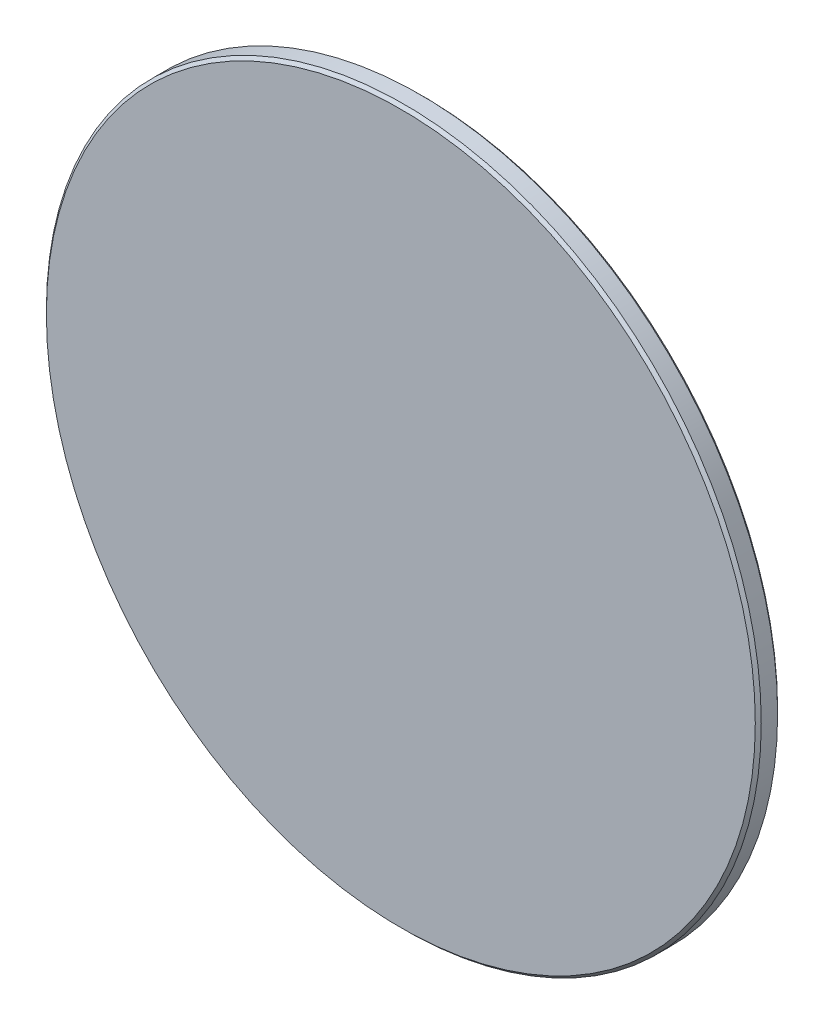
ISO-10303-21;
HEADER;
FILE_DESCRIPTION(('STEP AP214'),'2;1');
FILE_NAME('part.step','',(''),(''),'','','');
FILE_SCHEMA(('AUTOMOTIVE_DESIGN { 1 0 10303 214 1 1 1 1 }'));
ENDSEC;
DATA;
#1=APPLICATION_CONTEXT('core data for automotive mechanical design processes');
#2=APPLICATION_PROTOCOL_DEFINITION('international standard','automotive_design',2000,#1);
#3=PRODUCT_CONTEXT('',#1,'mechanical');
#4=PRODUCT('Part','Part','',(#3));
#5=PRODUCT_RELATED_PRODUCT_CATEGORY('part','',(#4));
#6=PRODUCT_DEFINITION_FORMATION('','',#4);
#7=PRODUCT_DEFINITION_CONTEXT('part definition',#1,'design');
#8=PRODUCT_DEFINITION('design','',#6,#7);
#9=PRODUCT_DEFINITION_SHAPE('','',#8);
#10=(LENGTH_UNIT() NAMED_UNIT(*) SI_UNIT(.MILLI.,.METRE.));
#11=(NAMED_UNIT(*) PLANE_ANGLE_UNIT() SI_UNIT($,.RADIAN.));
#12=(NAMED_UNIT(*) SI_UNIT($,.STERADIAN.) SOLID_ANGLE_UNIT());
#13=UNCERTAINTY_MEASURE_WITH_UNIT(LENGTH_MEASURE(1.E-05),#10,'distance_accuracy_value','');
#14=(GEOMETRIC_REPRESENTATION_CONTEXT(3) GLOBAL_UNCERTAINTY_ASSIGNED_CONTEXT((#13)) GLOBAL_UNIT_ASSIGNED_CONTEXT((#10,
#11,#12)) REPRESENTATION_CONTEXT('',''));
#15=CARTESIAN_POINT('',(0.,0.,0.));
#16=DIRECTION('',(0.,0.,1.));
#17=DIRECTION('',(1.,0.,0.));
#18=AXIS2_PLACEMENT_3D('',#15,#16,#17);
#19=CARTESIAN_POINT('',(0.,0.,2.38125));
#20=DIRECTION('',(0.,0.,-1.));
#21=DIRECTION('',(-1.,0.,0.));
#22=AXIS2_PLACEMENT_3D('',#19,#20,#21);
#23=CYLINDRICAL_SURFACE('',#22,76.2);
#24=CARTESIAN_POINT('',(0.,0.,-1.74624999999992));
#25=DIRECTION('',(0.,0.,1.));
#26=DIRECTION('',(1.,0.,0.));
#27=AXIS2_PLACEMENT_3D('',#24,#25,#26);
#28=CIRCLE('',#27,76.2);
#29=CARTESIAN_POINT('',(-76.2,0.,-1.74624999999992));
#30=VERTEX_POINT('',#29);
#31=EDGE_CURVE('E46',#30,#30,#28,.T.);
#32=CARTESIAN_POINT('',(0.,0.,1.74625000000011));
#33=DIRECTION('',(0.,0.,1.));
#34=DIRECTION('',(1.,0.,0.));
#35=AXIS2_PLACEMENT_3D('',#32,#33,#34);
#36=CIRCLE('',#35,76.2);
#37=CARTESIAN_POINT('',(-76.2,0.,1.74625000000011));
#38=VERTEX_POINT('',#37);
#39=EDGE_CURVE('E50',#38,#38,#36,.F.);
#40=CARTESIAN_POINT('',(-76.2,0.,-1.74624999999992));
#41=CARTESIAN_POINT('',(-76.2,0.,-1.70986979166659));
#42=CARTESIAN_POINT('',(-76.2,0.,-1.67348958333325));
#43=CARTESIAN_POINT('',(-76.2,0.,-1.60072916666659));
#44=CARTESIAN_POINT('',(-76.2,0.,-1.56434895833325));
#45=CARTESIAN_POINT('',(-76.2,0.,-1.49158854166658));
#46=CARTESIAN_POINT('',(-76.2,0.,-1.45520833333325));
#47=CARTESIAN_POINT('',(-76.2,0.,-1.38244791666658));
#48=CARTESIAN_POINT('',(-76.2,0.,-1.34606770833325));
#49=CARTESIAN_POINT('',(-76.2,0.,-1.27330729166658));
#50=CARTESIAN_POINT('',(-76.2,0.,-1.23692708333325));
#51=CARTESIAN_POINT('',(-76.2,0.,-1.16416666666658));
#52=CARTESIAN_POINT('',(-76.2,0.,-1.12778645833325));
#53=CARTESIAN_POINT('',(-76.2,0.,-1.05502604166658));
#54=CARTESIAN_POINT('',(-76.2,0.,-1.01864583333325));
#55=CARTESIAN_POINT('',(-76.2,0.,-0.945885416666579));
#56=CARTESIAN_POINT('',(-76.2,0.,-0.909505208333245));
#57=CARTESIAN_POINT('',(-76.2,0.,-0.836744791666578));
#58=CARTESIAN_POINT('',(-76.2,0.,-0.800364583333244));
#59=CARTESIAN_POINT('',(-76.2,0.,-0.727604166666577));
#60=CARTESIAN_POINT('',(-76.2,0.,-0.691223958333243));
#61=CARTESIAN_POINT('',(-76.2,0.,-0.618463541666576));
#62=CARTESIAN_POINT('',(-76.2,0.,-0.582083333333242));
#63=CARTESIAN_POINT('',(-76.2,0.,-0.509322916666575));
#64=CARTESIAN_POINT('',(-76.2,0.,-0.472942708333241));
#65=CARTESIAN_POINT('',(-76.2,0.,-0.400182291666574));
#66=CARTESIAN_POINT('',(-76.2,0.,-0.36380208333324));
#67=CARTESIAN_POINT('',(-76.2,0.,-0.291041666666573));
#68=CARTESIAN_POINT('',(-76.2,0.,-0.254661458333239));
#69=CARTESIAN_POINT('',(-76.2,0.,-0.181901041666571));
#70=CARTESIAN_POINT('',(-76.2,0.,-0.145520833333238));
#71=CARTESIAN_POINT('',(-76.2,0.,-0.0727604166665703));
#72=CARTESIAN_POINT('',(-76.2,0.,-0.0363802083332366));
#73=CARTESIAN_POINT('',(-76.2,0.,0.0363802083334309));
#74=CARTESIAN_POINT('',(-76.2,0.,0.0727604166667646));
#75=CARTESIAN_POINT('',(-76.2,0.,0.145520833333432));
#76=CARTESIAN_POINT('',(-76.2,0.,0.181901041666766));
#77=CARTESIAN_POINT('',(-76.2,0.,0.254661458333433));
#78=CARTESIAN_POINT('',(-76.2,0.,0.291041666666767));
#79=CARTESIAN_POINT('',(-76.2,0.,0.363802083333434));
#80=CARTESIAN_POINT('',(-76.2,0.,0.400182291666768));
#81=CARTESIAN_POINT('',(-76.2,0.,0.472942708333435));
#82=CARTESIAN_POINT('',(-76.2,0.,0.509322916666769));
#83=CARTESIAN_POINT('',(-76.2,0.,0.582083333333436));
#84=CARTESIAN_POINT('',(-76.2,0.,0.61846354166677));
#85=CARTESIAN_POINT('',(-76.2,0.,0.691223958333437));
#86=CARTESIAN_POINT('',(-76.2,0.,0.727604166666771));
#87=CARTESIAN_POINT('',(-76.2,0.,0.800364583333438));
#88=CARTESIAN_POINT('',(-76.2,0.,0.836744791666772));
#89=CARTESIAN_POINT('',(-76.2,0.,0.90950520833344));
#90=CARTESIAN_POINT('',(-76.2,0.,0.945885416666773));
#91=CARTESIAN_POINT('',(-76.2,0.,1.01864583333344));
#92=CARTESIAN_POINT('',(-76.2,0.,1.05502604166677));
#93=CARTESIAN_POINT('',(-76.2,0.,1.12778645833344));
#94=CARTESIAN_POINT('',(-76.2,0.,1.16416666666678));
#95=CARTESIAN_POINT('',(-76.2,0.,1.23692708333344));
#96=CARTESIAN_POINT('',(-76.2,0.,1.27330729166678));
#97=CARTESIAN_POINT('',(-76.2,0.,1.34606770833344));
#98=CARTESIAN_POINT('',(-76.2,0.,1.38244791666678));
#99=CARTESIAN_POINT('',(-76.2,0.,1.45520833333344));
#100=CARTESIAN_POINT('',(-76.2,0.,1.49158854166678));
#101=CARTESIAN_POINT('',(-76.2,0.,1.56434895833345));
#102=CARTESIAN_POINT('',(-76.2,0.,1.60072916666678));
#103=CARTESIAN_POINT('',(-76.2,0.,1.67348958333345));
#104=CARTESIAN_POINT('',(-76.2,0.,1.70986979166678));
#105=CARTESIAN_POINT('',(-76.2,0.,1.74625000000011));
#106=B_SPLINE_CURVE_WITH_KNOTS('',3,(#40,#41,#42,#43,#44,#45,#46,#47,#48,#49,#50,#51,#52,#53,
#54,#55,#56,#57,#58,#59,#60,#61,#62,#63,#64,#65,#66,#67,#68,#69,#70,#71,#72,#73,#74,#75,#76,#77,
#78,#79,#80,#81,#82,#83,#84,#85,#86,#87,#88,#89,#90,#91,#92,#93,#94,#95,#96,#97,#98,#99,#100,
#101,#102,#103,#104,#105),.UNSPECIFIED.,.F.,.F.,(4,2,2,2,2,2,2,2,2,2,2,2,2,2,2,2,2,2,2,2,2,2,2,
2,2,2,2,2,2,2,2,2,4),(0.,0.109140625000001,0.218281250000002,0.327421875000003,
0.436562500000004,0.545703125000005,0.654843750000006,0.763984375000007,0.873125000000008,
0.98226562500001,1.09140625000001,1.20054687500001,1.30968750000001,1.41882812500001,
1.52796875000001,1.63710937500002,1.74625000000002,1.85539062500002,1.96453125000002,
2.07367187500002,2.18281250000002,2.29195312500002,2.40109375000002,2.51023437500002,
2.61937500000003,2.72851562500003,2.83765625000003,2.94679687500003,3.05593750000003,
3.16507812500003,3.27421875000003,3.38335937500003,3.49250000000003),.UNSPECIFIED.);
#107=EDGE_CURVE('BSEAM35',#30,#38,#106,.T.);
#108=ORIENTED_EDGE('',*,*,#31,.T.);
#109=ORIENTED_EDGE('',*,*,#39,.T.);
#110=ORIENTED_EDGE('',*,*,#107,.T.);
#111=ORIENTED_EDGE('',*,*,#107,.F.);
#112=EDGE_LOOP('',(#108,#110,#109,#111));
#113=FACE_BOUND('',#112,.T.);
#114=ADVANCED_FACE('F35',(#113),#23,.T.);
#115=CARTESIAN_POINT('',(0.,0.,2.38125));
#116=DIRECTION('',(0.,0.,1.));
#117=DIRECTION('',(1.,0.,0.));
#118=AXIS2_PLACEMENT_3D('',#115,#116,#117);
#119=PLANE('',#118);
#120=CARTESIAN_POINT('',(0.,0.,2.38125));
#121=DIRECTION('',(0.,0.,1.));
#122=DIRECTION('',(1.,0.,0.));
#123=AXIS2_PLACEMENT_3D('',#120,#121,#122);
#124=CIRCLE('',#123,75.5650000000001);
#125=CARTESIAN_POINT('',(75.5650000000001,0.,2.38125));
#126=VERTEX_POINT('',#125);
#127=EDGE_CURVE('E10',#126,#126,#124,.T.);
#128=ORIENTED_EDGE('',*,*,#127,.T.);
#129=EDGE_LOOP('',(#128));
#130=FACE_BOUND('',#129,.T.);
#131=ADVANCED_FACE('F66',(#130),#119,.T.);
#132=CARTESIAN_POINT('',(0.,0.,-2.38125));
#133=DIRECTION('',(0.,0.,1.));
#134=DIRECTION('',(1.,0.,0.));
#135=AXIS2_PLACEMENT_3D('',#132,#133,#134);
#136=PLANE('',#135);
#137=CARTESIAN_POINT('',(0.,0.,-2.38125));
#138=DIRECTION('',(0.,0.,1.));
#139=DIRECTION('',(1.,0.,0.));
#140=AXIS2_PLACEMENT_3D('',#137,#138,#139);
#141=CIRCLE('',#140,75.5649999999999);
#142=CARTESIAN_POINT('',(75.5649999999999,0.,-2.38125));
#143=VERTEX_POINT('',#142);
#144=EDGE_CURVE('E42',#143,#143,#141,.F.);
#145=ORIENTED_EDGE('',*,*,#144,.T.);
#146=EDGE_LOOP('',(#145));
#147=FACE_BOUND('',#146,.T.);
#148=ADVANCED_FACE('F63',(#147),#136,.F.);
#149=CARTESIAN_POINT('',(0.,0.,-1.74624999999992));
#150=DIRECTION('',(0.,0.,1.));
#151=DIRECTION('',(1.,0.,0.));
#152=AXIS2_PLACEMENT_3D('',#149,#150,#151);
#153=CONICAL_SURFACE('',#152,76.2,0.785398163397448);
#154=ORIENTED_EDGE('',*,*,#144,.F.);
#155=EDGE_LOOP('',(#154));
#156=FACE_BOUND('',#155,.T.);
#157=ORIENTED_EDGE('',*,*,#31,.F.);
#158=EDGE_LOOP('',(#157));
#159=FACE_BOUND('',#158,.T.);
#160=ADVANCED_FACE('F59',(#156,#159),#153,.T.);
#161=CARTESIAN_POINT('',(0.,0.,2.38125));
#162=DIRECTION('',(0.,0.,-1.));
#163=DIRECTION('',(-1.,0.,0.));
#164=AXIS2_PLACEMENT_3D('',#161,#162,#163);
#165=CONICAL_SURFACE('',#164,75.5650000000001,0.785398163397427);
#166=ORIENTED_EDGE('',*,*,#39,.F.);
#167=EDGE_LOOP('',(#166));
#168=FACE_BOUND('',#167,.T.);
#169=ORIENTED_EDGE('',*,*,#127,.F.);
#170=EDGE_LOOP('',(#169));
#171=FACE_BOUND('',#170,.T.);
#172=ADVANCED_FACE('F37',(#168,#171),#165,.T.);
#173=CLOSED_SHELL('',(#114,#131,#148,#160,#172));
#174=MANIFOLD_SOLID_BREP('B2',#173);
#175=ADVANCED_BREP_SHAPE_REPRESENTATION('',(#18,#174),#14);
#176=SHAPE_DEFINITION_REPRESENTATION(#9,#175);
ENDSEC;
END-ISO-10303-21;
